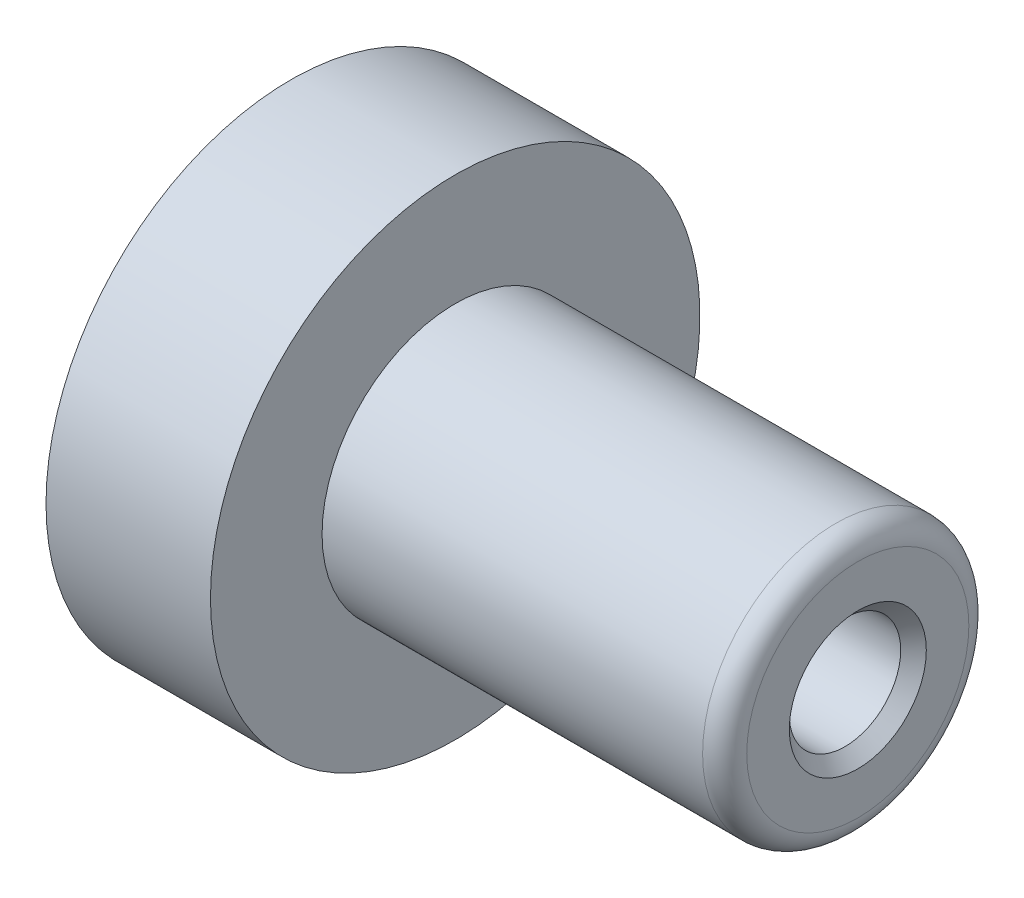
ISO-10303-21;
HEADER;
FILE_DESCRIPTION(('STEP AP214'),'2;1');
FILE_NAME('part.step','',(''),(''),'','','');
FILE_SCHEMA(('AUTOMOTIVE_DESIGN { 1 0 10303 214 1 1 1 1 }'));
ENDSEC;
DATA;
#1=APPLICATION_CONTEXT('core data for automotive mechanical design processes');
#2=APPLICATION_PROTOCOL_DEFINITION('international standard','automotive_design',2000,#1);
#3=PRODUCT_CONTEXT('',#1,'mechanical');
#4=PRODUCT('Part','Part','',(#3));
#5=PRODUCT_RELATED_PRODUCT_CATEGORY('part','',(#4));
#6=PRODUCT_DEFINITION_FORMATION('','',#4);
#7=PRODUCT_DEFINITION_CONTEXT('part definition',#1,'design');
#8=PRODUCT_DEFINITION('design','',#6,#7);
#9=PRODUCT_DEFINITION_SHAPE('','',#8);
#10=(LENGTH_UNIT() NAMED_UNIT(*) SI_UNIT(.MILLI.,.METRE.));
#11=(NAMED_UNIT(*) PLANE_ANGLE_UNIT() SI_UNIT($,.RADIAN.));
#12=(NAMED_UNIT(*) SI_UNIT($,.STERADIAN.) SOLID_ANGLE_UNIT());
#13=UNCERTAINTY_MEASURE_WITH_UNIT(LENGTH_MEASURE(1.E-05),#10,'distance_accuracy_value','');
#14=(GEOMETRIC_REPRESENTATION_CONTEXT(3) GLOBAL_UNCERTAINTY_ASSIGNED_CONTEXT((#13)) GLOBAL_UNIT_ASSIGNED_CONTEXT((#10,
#11,#12)) REPRESENTATION_CONTEXT('',''));
#15=CARTESIAN_POINT('',(0.,0.,0.));
#16=DIRECTION('',(0.,0.,1.));
#17=DIRECTION('',(1.,0.,0.));
#18=AXIS2_PLACEMENT_3D('',#15,#16,#17);
#19=CARTESIAN_POINT('',(0.,0.,0.));
#20=DIRECTION('',(-1.,0.,0.));
#21=DIRECTION('',(0.,0.,1.));
#22=AXIS2_PLACEMENT_3D('',#19,#20,#21);
#23=CYLINDRICAL_SURFACE('',#22,6.7437);
#24=CARTESIAN_POINT('',(20.4724,0.,0.));
#25=DIRECTION('',(-1.,0.,0.));
#26=DIRECTION('',(0.,0.,1.));
#27=AXIS2_PLACEMENT_3D('',#24,#25,#26);
#28=CIRCLE('',#27,6.7437);
#29=CARTESIAN_POINT('',(20.4724,0.,6.7437));
#30=VERTEX_POINT('',#29);
#31=EDGE_CURVE('E42',#30,#30,#28,.T.);
#32=ORIENTED_EDGE('',*,*,#31,.F.);
#33=EDGE_LOOP('',(#32));
#34=FACE_BOUND('',#33,.T.);
#35=CARTESIAN_POINT('',(0.,0.,0.));
#36=DIRECTION('',(-1.,0.,0.));
#37=DIRECTION('',(0.,0.,1.));
#38=AXIS2_PLACEMENT_3D('',#35,#36,#37);
#39=CIRCLE('',#38,6.7437);
#40=CARTESIAN_POINT('',(0.,0.,6.7437));
#41=VERTEX_POINT('',#40);
#42=EDGE_CURVE('E63',#41,#41,#39,.T.);
#43=ORIENTED_EDGE('',*,*,#42,.T.);
#44=EDGE_LOOP('',(#43));
#45=FACE_BOUND('',#44,.T.);
#46=ADVANCED_FACE('F31',(#34,#45),#23,.F.);
#47=CARTESIAN_POINT('',(20.4724,6.7437,0.));
#48=DIRECTION('',(1.,0.,0.));
#49=DIRECTION('',(0.,0.,-1.));
#50=AXIS2_PLACEMENT_3D('',#47,#48,#49);
#51=PLANE('',#50);
#52=ORIENTED_EDGE('',*,*,#31,.T.);
#53=EDGE_LOOP('',(#52));
#54=FACE_BOUND('',#53,.T.);
#55=ADVANCED_FACE('F97',(#54),#51,.F.);
#56=CARTESIAN_POINT('',(40.4622,7.9248,0.));
#57=DIRECTION('',(-1.,0.,0.));
#58=DIRECTION('',(0.,0.,1.));
#59=AXIS2_PLACEMENT_3D('',#56,#57,#58);
#60=PLANE('',#59);
#61=CARTESIAN_POINT('',(40.4622,0.,0.));
#62=DIRECTION('',(-1.,0.,0.));
#63=DIRECTION('',(0.,0.,1.));
#64=AXIS2_PLACEMENT_3D('',#61,#62,#63);
#65=CIRCLE('',#64,4.88950000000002);
#66=CARTESIAN_POINT('',(40.4622,0.,-4.88950000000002));
#67=VERTEX_POINT('',#66);
#68=EDGE_CURVE('E10',#67,#67,#65,.T.);
#69=ORIENTED_EDGE('',*,*,#68,.T.);
#70=EDGE_LOOP('',(#69));
#71=FACE_BOUND('',#70,.T.);
#72=CARTESIAN_POINT('',(40.4622,0.,0.));
#73=DIRECTION('',(-1.,0.,0.));
#74=DIRECTION('',(0.,0.,1.));
#75=AXIS2_PLACEMENT_3D('',#72,#73,#74);
#76=CIRCLE('',#75,7.9248);
#77=CARTESIAN_POINT('',(40.4622,0.,7.9248));
#78=VERTEX_POINT('',#77);
#79=EDGE_CURVE('E46',#78,#78,#76,.T.);
#80=ORIENTED_EDGE('',*,*,#79,.F.);
#81=EDGE_LOOP('',(#80));
#82=FACE_BOUND('',#81,.T.);
#83=ADVANCED_FACE('F102',(#71,#82),#60,.F.);
#84=CARTESIAN_POINT('',(38.8874,0.,0.));
#85=DIRECTION('',(-1.,0.,0.));
#86=DIRECTION('',(0.,0.,1.));
#87=AXIS2_PLACEMENT_3D('',#84,#85,#86);
#88=TOROIDAL_SURFACE('',#87,7.9248,1.5748);
#89=CARTESIAN_POINT('',(38.8874,0.,0.));
#90=DIRECTION('',(-1.,0.,0.));
#91=DIRECTION('',(0.,0.,1.));
#92=AXIS2_PLACEMENT_3D('',#89,#90,#91);
#93=CIRCLE('',#92,9.4996);
#94=CARTESIAN_POINT('',(38.8874,0.,9.4996));
#95=VERTEX_POINT('',#94);
#96=EDGE_CURVE('E51',#95,#95,#93,.T.);
#97=ORIENTED_EDGE('',*,*,#96,.F.);
#98=EDGE_LOOP('',(#97));
#99=FACE_BOUND('',#98,.T.);
#100=ORIENTED_EDGE('',*,*,#79,.T.);
#101=EDGE_LOOP('',(#100));
#102=FACE_BOUND('',#101,.T.);
#103=ADVANCED_FACE('F110',(#99,#102),#88,.T.);
#104=CARTESIAN_POINT('',(0.,0.,0.));
#105=DIRECTION('',(-1.,0.,0.));
#106=DIRECTION('',(0.,0.,1.));
#107=AXIS2_PLACEMENT_3D('',#104,#105,#106);
#108=CYLINDRICAL_SURFACE('',#107,9.4996);
#109=CARTESIAN_POINT('',(11.7348,0.,0.));
#110=DIRECTION('',(-1.,0.,0.));
#111=DIRECTION('',(0.,0.,1.));
#112=AXIS2_PLACEMENT_3D('',#109,#110,#111);
#113=CIRCLE('',#112,9.4996);
#114=CARTESIAN_POINT('',(11.7348,0.,9.4996));
#115=VERTEX_POINT('',#114);
#116=EDGE_CURVE('E54',#115,#115,#113,.T.);
#117=ORIENTED_EDGE('',*,*,#116,.F.);
#118=EDGE_LOOP('',(#117));
#119=FACE_BOUND('',#118,.T.);
#120=ORIENTED_EDGE('',*,*,#96,.T.);
#121=EDGE_LOOP('',(#120));
#122=FACE_BOUND('',#121,.T.);
#123=ADVANCED_FACE('F113',(#119,#122),#108,.T.);
#124=CARTESIAN_POINT('',(11.7348,17.4625,0.));
#125=DIRECTION('',(-1.,0.,0.));
#126=DIRECTION('',(0.,0.,1.));
#127=AXIS2_PLACEMENT_3D('',#124,#125,#126);
#128=PLANE('',#127);
#129=CARTESIAN_POINT('',(11.7348,0.,0.));
#130=DIRECTION('',(-1.,0.,0.));
#131=DIRECTION('',(0.,0.,1.));
#132=AXIS2_PLACEMENT_3D('',#129,#130,#131);
#133=CIRCLE('',#132,17.4625);
#134=CARTESIAN_POINT('',(11.7348,0.,17.4625));
#135=VERTEX_POINT('',#134);
#136=EDGE_CURVE('E57',#135,#135,#133,.T.);
#137=ORIENTED_EDGE('',*,*,#136,.F.);
#138=EDGE_LOOP('',(#137));
#139=FACE_BOUND('',#138,.T.);
#140=ORIENTED_EDGE('',*,*,#116,.T.);
#141=EDGE_LOOP('',(#140));
#142=FACE_BOUND('',#141,.T.);
#143=ADVANCED_FACE('F117',(#139,#142),#128,.F.);
#144=CARTESIAN_POINT('',(0.,0.,0.));
#145=DIRECTION('',(-1.,0.,0.));
#146=DIRECTION('',(0.,0.,1.));
#147=AXIS2_PLACEMENT_3D('',#144,#145,#146);
#148=CYLINDRICAL_SURFACE('',#147,17.4625);
#149=CARTESIAN_POINT('',(0.,0.,0.));
#150=DIRECTION('',(-1.,0.,0.));
#151=DIRECTION('',(0.,0.,1.));
#152=AXIS2_PLACEMENT_3D('',#149,#150,#151);
#153=CIRCLE('',#152,17.4625);
#154=CARTESIAN_POINT('',(0.,0.,17.4625));
#155=VERTEX_POINT('',#154);
#156=EDGE_CURVE('E60',#155,#155,#153,.T.);
#157=ORIENTED_EDGE('',*,*,#156,.F.);
#158=EDGE_LOOP('',(#157));
#159=FACE_BOUND('',#158,.T.);
#160=ORIENTED_EDGE('',*,*,#136,.T.);
#161=EDGE_LOOP('',(#160));
#162=FACE_BOUND('',#161,.T.);
#163=ADVANCED_FACE('F121',(#159,#162),#148,.T.);
#164=CARTESIAN_POINT('',(0.,6.7437,0.));
#165=DIRECTION('',(1.,0.,0.));
#166=DIRECTION('',(0.,0.,-1.));
#167=AXIS2_PLACEMENT_3D('',#164,#165,#166);
#168=PLANE('',#167);
#169=CARTESIAN_POINT('',(0.,-11.1125,0.));
#170=DIRECTION('',(-1.,0.,0.));
#171=DIRECTION('',(0.,0.,-1.));
#172=AXIS2_PLACEMENT_3D('',#169,#170,#171);
#173=CIRCLE('',#172,1.6129);
#174=CARTESIAN_POINT('',(0.,-11.1125,-1.6129));
#175=VERTEX_POINT('',#174);
#176=EDGE_CURVE('E73',#175,#175,#173,.T.);
#177=ORIENTED_EDGE('',*,*,#176,.F.);
#178=EDGE_LOOP('',(#177));
#179=FACE_BOUND('',#178,.T.);
#180=CARTESIAN_POINT('',(0.,11.1125,0.));
#181=DIRECTION('',(-1.,0.,0.));
#182=DIRECTION('',(0.,0.,1.));
#183=AXIS2_PLACEMENT_3D('',#180,#181,#182);
#184=CIRCLE('',#183,1.6129);
#185=CARTESIAN_POINT('',(0.,11.1125,1.6129));
#186=VERTEX_POINT('',#185);
#187=EDGE_CURVE('E67',#186,#186,#184,.T.);
#188=ORIENTED_EDGE('',*,*,#187,.F.);
#189=EDGE_LOOP('',(#188));
#190=FACE_BOUND('',#189,.T.);
#191=ORIENTED_EDGE('',*,*,#42,.F.);
#192=EDGE_LOOP('',(#191));
#193=FACE_BOUND('',#192,.T.);
#194=ORIENTED_EDGE('',*,*,#156,.T.);
#195=EDGE_LOOP('',(#194));
#196=FACE_BOUND('',#195,.T.);
#197=ADVANCED_FACE('F125',(#179,#190,#193,#196),#168,.F.);
#198=CARTESIAN_POINT('',(6.35,11.1125,0.));
#199=DIRECTION('',(-1.,0.,0.));
#200=DIRECTION('',(0.,0.,1.));
#201=AXIS2_PLACEMENT_3D('',#198,#199,#200);
#202=CYLINDRICAL_SURFACE('',#201,1.6129);
#203=CARTESIAN_POINT('',(6.35,11.1125,0.));
#204=DIRECTION('',(-1.,0.,0.));
#205=DIRECTION('',(0.,0.,1.));
#206=AXIS2_PLACEMENT_3D('',#203,#204,#205);
#207=CIRCLE('',#206,1.6129);
#208=CARTESIAN_POINT('',(6.35,11.1125,1.6129));
#209=VERTEX_POINT('',#208);
#210=EDGE_CURVE('E66',#209,#209,#207,.T.);
#211=ORIENTED_EDGE('',*,*,#210,.F.);
#212=EDGE_LOOP('',(#211));
#213=FACE_BOUND('',#212,.T.);
#214=ORIENTED_EDGE('',*,*,#187,.T.);
#215=EDGE_LOOP('',(#214));
#216=FACE_BOUND('',#215,.T.);
#217=ADVANCED_FACE('F129',(#213,#216),#202,.F.);
#218=CARTESIAN_POINT('',(6.35,11.1125,0.));
#219=DIRECTION('',(-1.,0.,0.));
#220=DIRECTION('',(0.,0.,1.));
#221=AXIS2_PLACEMENT_3D('',#218,#219,#220);
#222=PLANE('',#221);
#223=ORIENTED_EDGE('',*,*,#210,.T.);
#224=EDGE_LOOP('',(#223));
#225=FACE_BOUND('',#224,.T.);
#226=ADVANCED_FACE('F133',(#225),#222,.T.);
#227=CARTESIAN_POINT('',(6.35,-11.1125,0.));
#228=DIRECTION('',(-1.,0.,0.));
#229=DIRECTION('',(0.,0.,1.));
#230=AXIS2_PLACEMENT_3D('',#227,#228,#229);
#231=CYLINDRICAL_SURFACE('',#230,1.6129);
#232=CARTESIAN_POINT('',(6.35,-11.1125,0.));
#233=DIRECTION('',(-1.,0.,0.));
#234=DIRECTION('',(0.,0.,-1.));
#235=AXIS2_PLACEMENT_3D('',#232,#233,#234);
#236=CIRCLE('',#235,1.6129);
#237=CARTESIAN_POINT('',(6.35,-11.1125,-1.6129));
#238=VERTEX_POINT('',#237);
#239=EDGE_CURVE('E70',#238,#238,#236,.T.);
#240=ORIENTED_EDGE('',*,*,#239,.F.);
#241=EDGE_LOOP('',(#240));
#242=FACE_BOUND('',#241,.T.);
#243=ORIENTED_EDGE('',*,*,#176,.T.);
#244=EDGE_LOOP('',(#243));
#245=FACE_BOUND('',#244,.T.);
#246=ADVANCED_FACE('F93',(#242,#245),#231,.F.);
#247=CARTESIAN_POINT('',(6.35,-11.1125,0.));
#248=DIRECTION('',(1.,0.,0.));
#249=DIRECTION('',(0.,0.,-1.));
#250=AXIS2_PLACEMENT_3D('',#247,#248,#249);
#251=PLANE('',#250);
#252=ORIENTED_EDGE('',*,*,#239,.T.);
#253=EDGE_LOOP('',(#252));
#254=FACE_BOUND('',#253,.T.);
#255=ADVANCED_FACE('F86',(#254),#251,.F.);
#256=CARTESIAN_POINT('',(22.987,0.,0.));
#257=DIRECTION('',(1.,0.,0.));
#258=DIRECTION('',(0.,0.,-1.));
#259=AXIS2_PLACEMENT_3D('',#256,#257,#258);
#260=CYLINDRICAL_SURFACE('',#259,3.9751);
#261=CARTESIAN_POINT('',(39.5478,0.,0.));
#262=DIRECTION('',(-1.,0.,0.));
#263=DIRECTION('',(0.,0.,1.));
#264=AXIS2_PLACEMENT_3D('',#261,#262,#263);
#265=CIRCLE('',#264,3.9751);
#266=CARTESIAN_POINT('',(39.5478,0.,-3.9751));
#267=VERTEX_POINT('',#266);
#268=EDGE_CURVE('E38',#267,#267,#265,.F.);
#269=ORIENTED_EDGE('',*,*,#268,.T.);
#270=EDGE_LOOP('',(#269));
#271=FACE_BOUND('',#270,.T.);
#272=CARTESIAN_POINT('',(22.987,0.,0.));
#273=DIRECTION('',(1.,0.,0.));
#274=DIRECTION('',(0.,0.,-1.));
#275=AXIS2_PLACEMENT_3D('',#272,#273,#274);
#276=CIRCLE('',#275,3.9751);
#277=CARTESIAN_POINT('',(22.987,0.,-3.9751));
#278=VERTEX_POINT('',#277);
#279=EDGE_CURVE('E76',#278,#278,#276,.T.);
#280=ORIENTED_EDGE('',*,*,#279,.F.);
#281=EDGE_LOOP('',(#280));
#282=FACE_BOUND('',#281,.T.);
#283=ADVANCED_FACE('F84',(#271,#282),#260,.F.);
#284=CARTESIAN_POINT('',(22.987,0.,0.));
#285=DIRECTION('',(1.,0.,0.));
#286=DIRECTION('',(0.,0.,-1.));
#287=AXIS2_PLACEMENT_3D('',#284,#285,#286);
#288=PLANE('',#287);
#289=ORIENTED_EDGE('',*,*,#279,.T.);
#290=EDGE_LOOP('',(#289));
#291=FACE_BOUND('',#290,.T.);
#292=ADVANCED_FACE('F82',(#291),#288,.T.);
#293=CARTESIAN_POINT('',(39.5478,0.,0.));
#294=DIRECTION('',(1.,0.,0.));
#295=DIRECTION('',(0.,0.,-1.));
#296=AXIS2_PLACEMENT_3D('',#293,#294,#295);
#297=CONICAL_SURFACE('',#296,3.9751,0.78539816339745);
#298=CARTESIAN_POINT('',(40.4622,0.,-4.88950000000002));
#299=CARTESIAN_POINT('',(40.452675,0.,-4.87997500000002));
#300=CARTESIAN_POINT('',(40.44315,0.,-4.87045000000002));
#301=CARTESIAN_POINT('',(40.4241,0.,-4.85140000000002));
#302=CARTESIAN_POINT('',(40.414575,0.,-4.84187500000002));
#303=CARTESIAN_POINT('',(40.395525,0.,-4.82282500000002));
#304=CARTESIAN_POINT('',(40.386,0.,-4.81330000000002));
#305=CARTESIAN_POINT('',(40.36695,0.,-4.79425000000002));
#306=CARTESIAN_POINT('',(40.357425,0.,-4.78472500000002));
#307=CARTESIAN_POINT('',(40.338375,0.,-4.76567500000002));
#308=CARTESIAN_POINT('',(40.32885,0.,-4.75615000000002));
#309=CARTESIAN_POINT('',(40.3098,0.,-4.73710000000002));
#310=CARTESIAN_POINT('',(40.300275,0.,-4.72757500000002));
#311=CARTESIAN_POINT('',(40.281225,0.,-4.70852500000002));
#312=CARTESIAN_POINT('',(40.2717,0.,-4.69900000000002));
#313=CARTESIAN_POINT('',(40.25265,0.,-4.67995000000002));
#314=CARTESIAN_POINT('',(40.243125,0.,-4.67042500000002));
#315=CARTESIAN_POINT('',(40.224075,0.,-4.65137500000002));
#316=CARTESIAN_POINT('',(40.21455,0.,-4.64185000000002));
#317=CARTESIAN_POINT('',(40.1955,0.,-4.62280000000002));
#318=CARTESIAN_POINT('',(40.185975,0.,-4.61327500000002));
#319=CARTESIAN_POINT('',(40.166925,0.,-4.59422500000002));
#320=CARTESIAN_POINT('',(40.1574,0.,-4.58470000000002));
#321=CARTESIAN_POINT('',(40.13835,0.,-4.56565000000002));
#322=CARTESIAN_POINT('',(40.128825,0.,-4.55612500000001));
#323=CARTESIAN_POINT('',(40.109775,0.,-4.53707500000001));
#324=CARTESIAN_POINT('',(40.10025,0.,-4.52755000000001));
#325=CARTESIAN_POINT('',(40.0812,0.,-4.50850000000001));
#326=CARTESIAN_POINT('',(40.071675,0.,-4.49897500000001));
#327=CARTESIAN_POINT('',(40.052625,0.,-4.47992500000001));
#328=CARTESIAN_POINT('',(40.0431,0.,-4.47040000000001));
#329=CARTESIAN_POINT('',(40.02405,0.,-4.45135000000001));
#330=CARTESIAN_POINT('',(40.014525,0.,-4.44182500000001));
#331=CARTESIAN_POINT('',(39.995475,0.,-4.42277500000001));
#332=CARTESIAN_POINT('',(39.98595,0.,-4.41325000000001));
#333=CARTESIAN_POINT('',(39.9669,0.,-4.39420000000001));
#334=CARTESIAN_POINT('',(39.957375,0.,-4.38467500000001));
#335=CARTESIAN_POINT('',(39.938325,0.,-4.36562500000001));
#336=CARTESIAN_POINT('',(39.9288,0.,-4.35610000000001));
#337=CARTESIAN_POINT('',(39.90975,0.,-4.33705000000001));
#338=CARTESIAN_POINT('',(39.900225,0.,-4.32752500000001));
#339=CARTESIAN_POINT('',(39.881175,0.,-4.30847500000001));
#340=CARTESIAN_POINT('',(39.87165,0.,-4.29895000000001));
#341=CARTESIAN_POINT('',(39.8526,0.,-4.27990000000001));
#342=CARTESIAN_POINT('',(39.843075,0.,-4.27037500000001));
#343=CARTESIAN_POINT('',(39.824025,0.,-4.25132500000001));
#344=CARTESIAN_POINT('',(39.8145,0.,-4.24180000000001));
#345=CARTESIAN_POINT('',(39.79545,0.,-4.22275000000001));
#346=CARTESIAN_POINT('',(39.785925,0.,-4.21322500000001));
#347=CARTESIAN_POINT('',(39.766875,0.,-4.19417500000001));
#348=CARTESIAN_POINT('',(39.75735,0.,-4.18465000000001));
#349=CARTESIAN_POINT('',(39.7383,0.,-4.16560000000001));
#350=CARTESIAN_POINT('',(39.728775,0.,-4.15607500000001));
#351=CARTESIAN_POINT('',(39.709725,0.,-4.13702500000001));
#352=CARTESIAN_POINT('',(39.7002,0.,-4.12750000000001));
#353=CARTESIAN_POINT('',(39.68115,0.,-4.10845));
#354=CARTESIAN_POINT('',(39.671625,0.,-4.098925));
#355=CARTESIAN_POINT('',(39.652575,0.,-4.07987500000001));
#356=CARTESIAN_POINT('',(39.64305,0.,-4.07035000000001));
#357=CARTESIAN_POINT('',(39.624,0.,-4.0513));
#358=CARTESIAN_POINT('',(39.614475,0.,-4.041775));
#359=CARTESIAN_POINT('',(39.595425,0.,-4.022725));
#360=CARTESIAN_POINT('',(39.5859,0.,-4.0132));
#361=CARTESIAN_POINT('',(39.56685,0.,-3.99415));
#362=CARTESIAN_POINT('',(39.557325,0.,-3.984625));
#363=CARTESIAN_POINT('',(39.5478,0.,-3.9751));
#364=B_SPLINE_CURVE_WITH_KNOTS('',3,(#298,#299,#300,#301,#302,#303,#304,#305,#306,#307,#308,
#309,#310,#311,#312,#313,#314,#315,#316,#317,#318,#319,#320,#321,#322,#323,#324,#325,#326,#327,
#328,#329,#330,#331,#332,#333,#334,#335,#336,#337,#338,#339,#340,#341,#342,#343,#344,#345,#346,
#347,#348,#349,#350,#351,#352,#353,#354,#355,#356,#357,#358,#359,#360,#361,#362,#363),
.UNSPECIFIED.,.F.,.F.,(4,2,2,2,2,2,2,2,2,2,2,2,2,2,2,2,2,2,2,2,2,2,2,2,2,2,2,2,2,2,2,2,4),(0.,
0.0404111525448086,0.0808223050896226,0.121233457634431,0.161644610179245,0.202055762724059,
0.242466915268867,0.282878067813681,0.323289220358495,0.363700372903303,0.404111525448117,
0.444522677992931,0.484933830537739,0.525344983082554,0.565756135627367,0.606167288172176,
0.64657844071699,0.686989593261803,0.727400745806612,0.767811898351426,0.808223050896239,
0.848634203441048,0.889045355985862,0.929456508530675,0.969867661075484,1.0102788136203,
1.05068996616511,1.09110111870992,1.13151227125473,1.17192342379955,1.21233457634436,
1.25274572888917,1.29315688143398),.UNSPECIFIED.);
#365=EDGE_CURVE('BSEAM33',#67,#267,#364,.T.);
#366=ORIENTED_EDGE('',*,*,#68,.F.);
#367=ORIENTED_EDGE('',*,*,#268,.F.);
#368=ORIENTED_EDGE('',*,*,#365,.T.);
#369=ORIENTED_EDGE('',*,*,#365,.F.);
#370=EDGE_LOOP('',(#366,#368,#367,#369));
#371=FACE_BOUND('',#370,.T.);
#372=ADVANCED_FACE('F33',(#371),#297,.F.);
#373=CLOSED_SHELL('',(#46,#55,#83,#103,#123,#143,#163,#197,#217,#226,#246,#255,#283,#292,#372));
#374=MANIFOLD_SOLID_BREP('B2',#373);
#375=ADVANCED_BREP_SHAPE_REPRESENTATION('',(#18,#374),#14);
#376=SHAPE_DEFINITION_REPRESENTATION(#9,#375);
ENDSEC;
END-ISO-10303-21;
